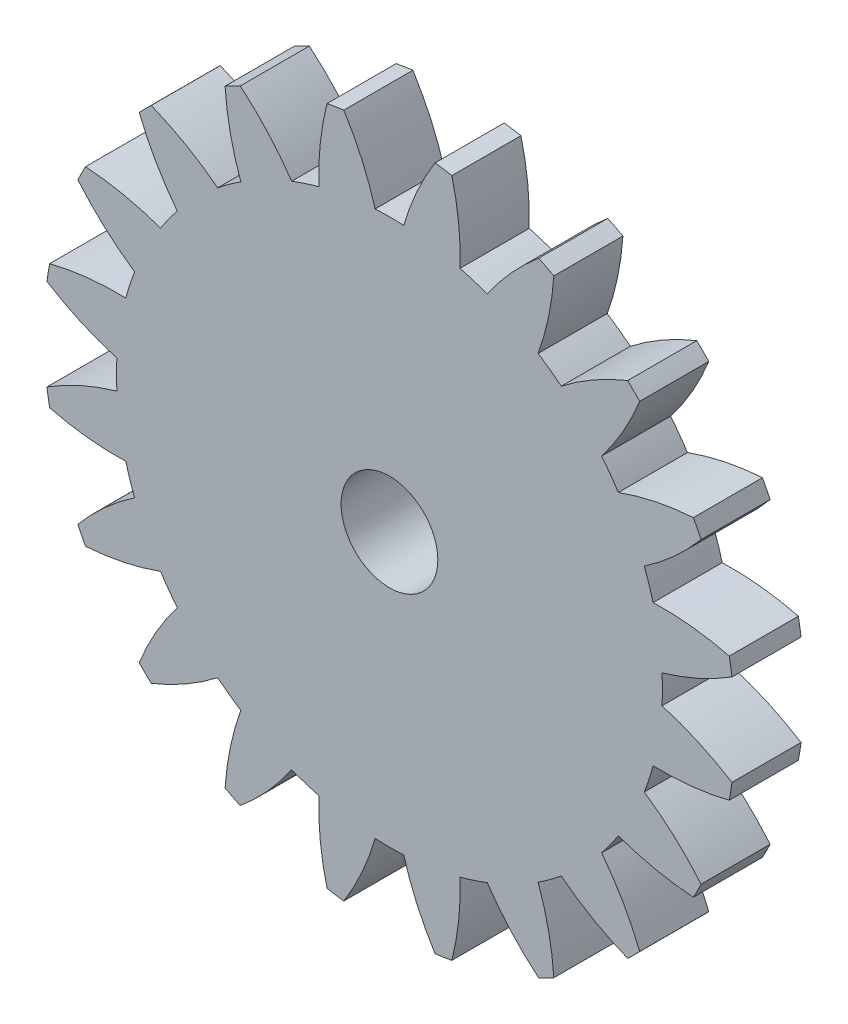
from build123d import *

# Parameters (mm, degrees)
SKETCH_1_R      = 39.5
SKETCH_1_R_2    = 7
EXTRUDE_1_DEPTH = 10


with BuildPart() as part:
    # Sketch 1 → Extrude 1 (new body)
    # profile 1 of 21: a face of its own
    with BuildSketch(Plane.XY):
        with Locations((0, -15.5)):
            Circle(SKETCH_1_R)
        with Locations((0, -15.5)):
            Circle(SKETCH_1_R_2, mode=Mode.SUBTRACT)
    # profile 2 of 21: a face of its own
    with BuildSketch(Plane.XY):
        with BuildLine():
            ThreePointArc((-30.697265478, 9.358155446), (-27.930717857, 12.430717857), (-24.858155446, 15.197265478))
            ThreePointArc((-24.858155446, 15.197265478), (-29.473873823, 18.291664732), (-34.474965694, 20.714316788))
            ThreePointArc((-34.474965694, 20.714316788), (-35.355339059, 19.855339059), (-36.214316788, 18.974965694))
            ThreePointArc((-36.214316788, 18.974965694), (-33.791664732, 13.973873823), (-30.697265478, 9.358155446))
        make_face()
    # profile 3 of 21: a face of its own
    with BuildSketch(Plane.XY):
        with BuildLine():
            ThreePointArc((-21.513241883, 17.627487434), (-17.93262474, 19.694757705), (-14.155534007, 21.376426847))
            ThreePointArc((-14.155534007, 21.376426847), (-17.58912109, 25.745710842), (-21.596801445, 29.595212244))
            ThreePointArc((-21.596801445, 29.595212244), (-22.699524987, 29.050326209), (-23.788511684, 28.478480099))
            ThreePointArc((-23.788511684, 28.478480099), (-23.029855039, 22.973518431), (-21.513241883, 17.627487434))
        make_face()
    # profile 4 of 21: a face of its own
    with BuildSketch(Plane.XY):
        with BuildLine():
            ThreePointArc((-10.223352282, 22.654070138), (-6.179161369, 23.513689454), (-2.067270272, 23.945866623))
            ThreePointArc((-2.067270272, 23.945866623), (-3.982622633, 29.162339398), (-6.604591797, 34.061874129))
            ThreePointArc((-6.604591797, 34.061874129), (-7.821723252, 33.88441703), (-9.034121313, 33.677074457))
            ThreePointArc((-9.034121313, 33.677074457), (-10.013722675, 28.207106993), (-10.223352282, 22.654070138))
        make_face()
    # profile 5 of 21: a face of its own
    with BuildSketch(Plane.XY):
        with BuildLine():
            ThreePointArc((2.067270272, 23.945866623), (6.179161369, 23.513689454), (10.223352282, 22.654070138))
            ThreePointArc((10.223352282, 22.654070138), (10.013722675, 28.207106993), (9.034121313, 33.677074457))
            ThreePointArc((9.034121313, 33.677074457), (7.821723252, 33.88441703), (6.604591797, 34.061874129))
            ThreePointArc((6.604591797, 34.061874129), (3.982622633, 29.162339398), (2.067270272, 23.945866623))
        make_face()
    # profile 6 of 21: a face of its own
    with BuildSketch(Plane.XY):
        with BuildLine():
            ThreePointArc((14.155534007, 21.376426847), (17.93262474, 19.694757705), (21.513241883, 17.627487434))
            ThreePointArc((21.513241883, 17.627487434), (23.029855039, 22.973518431), (23.788511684, 28.478480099))
            ThreePointArc((23.788511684, 28.478480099), (22.699524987, 29.050326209), (21.596801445, 29.595212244))
            ThreePointArc((21.596801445, 29.595212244), (17.58912109, 25.745710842), (14.155534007, 21.376426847))
        make_face()
    # profile 7 of 21: a face of its own
    with BuildSketch(Plane.XY):
        with BuildLine():
            ThreePointArc((24.858155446, 15.197265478), (27.930717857, 12.430717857), (30.697265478, 9.358155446))
            ThreePointArc((30.697265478, 9.358155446), (33.791664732, 13.973873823), (36.214316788, 18.974965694))
            ThreePointArc((36.214316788, 18.974965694), (35.355339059, 19.855339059), (34.474965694, 20.714316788))
            ThreePointArc((34.474965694, 20.714316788), (29.473873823, 18.291664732), (24.858155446, 15.197265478))
        make_face()
    # profile 8 of 21: a face of its own
    with BuildSketch(Plane.XY):
        with BuildLine():
            ThreePointArc((33.127487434, 6.013241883), (35.194757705, 2.43262474), (36.876426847, -1.344465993))
            ThreePointArc((36.876426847, -1.344465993), (41.245710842, 2.08912109), (45.095212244, 6.096801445))
            ThreePointArc((45.095212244, 6.096801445), (44.550326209, 7.199524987), (43.978480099, 8.288511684))
            ThreePointArc((43.978480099, 8.288511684), (38.473518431, 7.529855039), (33.127487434, 6.013241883))
        make_face()
    # profile 9 of 21: a face of its own
    with BuildSketch(Plane.XY):
        with BuildLine():
            ThreePointArc((38.154070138, -5.276647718), (39.013689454, -9.320838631), (39.445866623, -13.432729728))
            ThreePointArc((39.445866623, -13.432729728), (44.662339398, -11.517377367), (49.561874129, -8.895408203))
            ThreePointArc((49.561874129, -8.895408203), (49.38441703, -7.678276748), (49.177074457, -6.465878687))
            ThreePointArc((49.177074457, -6.465878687), (43.707106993, -5.486277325), (38.154070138, -5.276647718))
        make_face()
    # profile 10 of 21: a face of its own
    with BuildSketch(Plane.XY):
        with BuildLine():
            ThreePointArc((49.561874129, -22.104591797), (44.662339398, -19.482622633), (39.445866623, -17.567270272))
            ThreePointArc((39.445866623, -17.567270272), (39.013689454, -21.679161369), (38.154070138, -25.723352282))
            ThreePointArc((38.154070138, -25.723352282), (43.707106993, -25.513722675), (49.177074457, -24.534121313))
            ThreePointArc((49.177074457, -24.534121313), (49.38441703, -23.321723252), (49.561874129, -22.104591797))
        make_face()
    # profile 11 of 21: a face of its own
    with BuildSketch(Plane.XY):
        with BuildLine():
            ThreePointArc((45.095212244, -37.096801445), (41.245710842, -33.08912109), (36.876426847, -29.655534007))
            ThreePointArc((36.876426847, -29.655534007), (35.194757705, -33.43262474), (33.127487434, -37.013241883))
            ThreePointArc((33.127487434, -37.013241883), (38.473518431, -38.529855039), (43.978480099, -39.288511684))
            ThreePointArc((43.978480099, -39.288511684), (44.550326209, -38.199524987), (45.095212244, -37.096801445))
        make_face()
    # profile 12 of 21: a face of its own
    with BuildSketch(Plane.XY):
        with BuildLine():
            ThreePointArc((36.214316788, -49.974965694), (33.791664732, -44.973873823), (30.697265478, -40.358155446))
            ThreePointArc((30.697265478, -40.358155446), (27.930717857, -43.430717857), (24.858155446, -46.197265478))
            ThreePointArc((24.858155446, -46.197265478), (29.473873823, -49.291664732), (34.474965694, -51.714316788))
            ThreePointArc((34.474965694, -51.714316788), (35.355339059, -50.855339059), (36.214316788, -49.974965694))
        make_face()
    # profile 13 of 21: a face of its own
    with BuildSketch(Plane.XY):
        with BuildLine():
            ThreePointArc((23.788511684, -59.478480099), (23.029855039, -53.973518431), (21.513241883, -48.627487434))
            ThreePointArc((21.513241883, -48.627487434), (17.93262474, -50.694757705), (14.155534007, -52.376426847))
            ThreePointArc((14.155534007, -52.376426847), (17.58912109, -56.745710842), (21.596801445, -60.595212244))
            ThreePointArc((21.596801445, -60.595212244), (22.699524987, -60.050326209), (23.788511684, -59.478480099))
        make_face()
    # profile 14 of 21: a face of its own
    with BuildSketch(Plane.XY):
        with BuildLine():
            ThreePointArc((9.034121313, -64.677074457), (10.013722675, -59.207106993), (10.223352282, -53.654070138))
            ThreePointArc((10.223352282, -53.654070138), (6.179161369, -54.513689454), (2.067270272, -54.945866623))
            ThreePointArc((2.067270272, -54.945866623), (3.982622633, -60.162339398), (6.604591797, -65.061874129))
            ThreePointArc((6.604591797, -65.061874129), (7.821723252, -64.88441703), (9.034121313, -64.677074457))
        make_face()
    # profile 15 of 21: a face of its own
    with BuildSketch(Plane.XY):
        with BuildLine():
            ThreePointArc((-6.604591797, -65.061874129), (-3.982622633, -60.162339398), (-2.067270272, -54.945866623))
            ThreePointArc((-2.067270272, -54.945866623), (-6.179161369, -54.513689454), (-10.223352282, -53.654070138))
            ThreePointArc((-10.223352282, -53.654070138), (-10.013722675, -59.207106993), (-9.034121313, -64.677074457))
            ThreePointArc((-9.034121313, -64.677074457), (-7.821723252, -64.88441703), (-6.604591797, -65.061874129))
        make_face()
    # profile 16 of 21: a face of its own
    with BuildSketch(Plane.XY):
        with BuildLine():
            ThreePointArc((-21.596801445, -60.595212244), (-17.58912109, -56.745710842), (-14.155534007, -52.376426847))
            ThreePointArc((-14.155534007, -52.376426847), (-17.93262474, -50.694757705), (-21.513241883, -48.627487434))
            ThreePointArc((-21.513241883, -48.627487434), (-23.029855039, -53.973518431), (-23.788511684, -59.478480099))
            ThreePointArc((-23.788511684, -59.478480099), (-22.699524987, -60.050326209), (-21.596801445, -60.595212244))
        make_face()
    # profile 17 of 21: a face of its own
    with BuildSketch(Plane.XY):
        with BuildLine():
            ThreePointArc((-34.474965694, -51.714316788), (-29.473873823, -49.291664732), (-24.858155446, -46.197265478))
            ThreePointArc((-24.858155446, -46.197265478), (-27.930717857, -43.430717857), (-30.697265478, -40.358155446))
            ThreePointArc((-30.697265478, -40.358155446), (-33.791664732, -44.973873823), (-36.214316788, -49.974965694))
            ThreePointArc((-36.214316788, -49.974965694), (-35.355339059, -50.855339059), (-34.474965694, -51.714316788))
        make_face()
    # profile 18 of 21: a face of its own
    with BuildSketch(Plane.XY):
        with BuildLine():
            ThreePointArc((-43.978480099, -39.288511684), (-38.473518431, -38.529855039), (-33.127487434, -37.013241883))
            ThreePointArc((-33.127487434, -37.013241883), (-35.194757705, -33.43262474), (-36.876426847, -29.655534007))
            ThreePointArc((-36.876426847, -29.655534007), (-41.245710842, -33.08912109), (-45.095212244, -37.096801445))
            ThreePointArc((-45.095212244, -37.096801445), (-44.550326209, -38.199524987), (-43.978480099, -39.288511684))
        make_face()
    # profile 19 of 21: a face of its own
    with BuildSketch(Plane.XY):
        with BuildLine():
            ThreePointArc((-49.177074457, -24.534121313), (-43.707106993, -25.513722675), (-38.154070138, -25.723352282))
            ThreePointArc((-38.154070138, -25.723352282), (-39.013689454, -21.679161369), (-39.445866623, -17.567270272))
            ThreePointArc((-39.445866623, -17.567270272), (-44.662339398, -19.482622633), (-49.561874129, -22.104591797))
            ThreePointArc((-49.561874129, -22.104591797), (-49.38441703, -23.321723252), (-49.177074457, -24.534121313))
        make_face()
    # profile 20 of 21: a face of its own
    with BuildSketch(Plane.XY):
        with BuildLine():
            ThreePointArc((-39.445866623, -13.432729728), (-39.013689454, -9.320838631), (-38.154070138, -5.276647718))
            ThreePointArc((-38.154070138, -5.276647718), (-43.707106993, -5.486277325), (-49.177074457, -6.465878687))
            ThreePointArc((-49.177074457, -6.465878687), (-49.38441703, -7.678276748), (-49.561874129, -8.895408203))
            ThreePointArc((-49.561874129, -8.895408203), (-44.662339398, -11.517377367), (-39.445866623, -13.432729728))
        make_face()
    # profile 21 of 21: a face of its own
    with BuildSketch(Plane.XY):
        with BuildLine():
            ThreePointArc((-36.876426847, -1.344465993), (-35.194757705, 2.43262474), (-33.127487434, 6.013241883))
            ThreePointArc((-33.127487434, 6.013241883), (-38.473518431, 7.529855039), (-43.978480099, 8.288511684))
            ThreePointArc((-43.978480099, 8.288511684), (-44.550326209, 7.199524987), (-45.095212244, 6.096801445))
            ThreePointArc((-45.095212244, 6.096801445), (-41.245710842, 2.08912109), (-36.876426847, -1.344465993))
        make_face()
    extrude(amount=EXTRUDE_1_DEPTH)


solid = part.part
